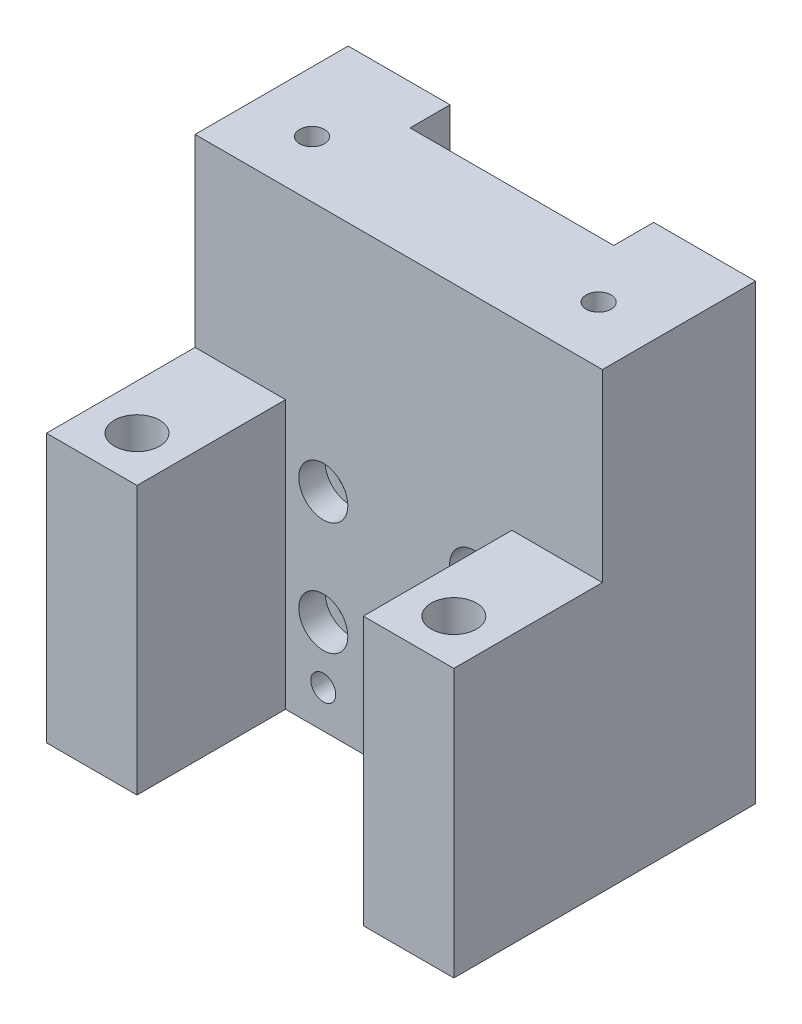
ISO-10303-21;
HEADER;
FILE_DESCRIPTION(('STEP AP214'),'2;1');
FILE_NAME('part.step','',(''),(''),'','','');
FILE_SCHEMA(('AUTOMOTIVE_DESIGN { 1 0 10303 214 1 1 1 1 }'));
ENDSEC;
DATA;
#1=APPLICATION_CONTEXT('core data for automotive mechanical design processes');
#2=APPLICATION_PROTOCOL_DEFINITION('international standard','automotive_design',2000,#1);
#3=PRODUCT_CONTEXT('',#1,'mechanical');
#4=PRODUCT('Part','Part','',(#3));
#5=PRODUCT_RELATED_PRODUCT_CATEGORY('part','',(#4));
#6=PRODUCT_DEFINITION_FORMATION('','',#4);
#7=PRODUCT_DEFINITION_CONTEXT('part definition',#1,'design');
#8=PRODUCT_DEFINITION('design','',#6,#7);
#9=PRODUCT_DEFINITION_SHAPE('','',#8);
#10=(LENGTH_UNIT() NAMED_UNIT(*) SI_UNIT(.MILLI.,.METRE.));
#11=(NAMED_UNIT(*) PLANE_ANGLE_UNIT() SI_UNIT($,.RADIAN.));
#12=(NAMED_UNIT(*) SI_UNIT($,.STERADIAN.) SOLID_ANGLE_UNIT());
#13=UNCERTAINTY_MEASURE_WITH_UNIT(LENGTH_MEASURE(1.E-05),#10,'distance_accuracy_value','');
#14=(GEOMETRIC_REPRESENTATION_CONTEXT(3) GLOBAL_UNCERTAINTY_ASSIGNED_CONTEXT((#13)) GLOBAL_UNIT_ASSIGNED_CONTEXT((#10,
#11,#12)) REPRESENTATION_CONTEXT('',''));
#15=CARTESIAN_POINT('',(0.,0.,0.));
#16=DIRECTION('',(0.,0.,1.));
#17=DIRECTION('',(1.,0.,0.));
#18=AXIS2_PLACEMENT_3D('',#15,#16,#17);
#19=CARTESIAN_POINT('',(17.,27.5000000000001,40.));
#20=DIRECTION('',(0.,0.,-1.));
#21=DIRECTION('',(-1.,0.,0.));
#22=AXIS2_PLACEMENT_3D('',#19,#20,#21);
#23=CYLINDRICAL_SURFACE('',#22,1.75);
#24=CARTESIAN_POINT('',(17.,27.5000000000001,5.29999999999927));
#25=DIRECTION('',(0.,0.,-1.));
#26=DIRECTION('',(-1.,0.,0.));
#27=AXIS2_PLACEMENT_3D('',#24,#25,#26);
#28=CIRCLE('',#27,1.75);
#29=CARTESIAN_POINT('',(15.25,27.5000000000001,5.29999999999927));
#30=VERTEX_POINT('',#29);
#31=EDGE_CURVE('E202',#30,#30,#28,.T.);
#32=ORIENTED_EDGE('',*,*,#31,.T.);
#33=EDGE_LOOP('',(#32));
#34=FACE_BOUND('',#33,.T.);
#35=CARTESIAN_POINT('',(17.,27.5000000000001,16.8000000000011));
#36=DIRECTION('',(0.,0.,1.));
#37=DIRECTION('',(1.,0.,0.));
#38=AXIS2_PLACEMENT_3D('',#35,#36,#37);
#39=CIRCLE('',#38,1.75);
#40=CARTESIAN_POINT('',(18.75,27.5000000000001,16.8000000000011));
#41=VERTEX_POINT('',#40);
#42=EDGE_CURVE('E37',#41,#41,#39,.T.);
#43=ORIENTED_EDGE('',*,*,#42,.T.);
#44=EDGE_LOOP('',(#43));
#45=FACE_BOUND('',#44,.T.);
#46=ADVANCED_FACE('F33',(#34,#45),#23,.F.);
#47=CARTESIAN_POINT('',(37.,27.5000000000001,40.));
#48=DIRECTION('',(0.,0.,-1.));
#49=DIRECTION('',(-1.,0.,0.));
#50=AXIS2_PLACEMENT_3D('',#47,#48,#49);
#51=CYLINDRICAL_SURFACE('',#50,1.75);
#52=CARTESIAN_POINT('',(37.,27.5000000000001,5.29999999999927));
#53=DIRECTION('',(0.,0.,-1.));
#54=DIRECTION('',(-1.,0.,0.));
#55=AXIS2_PLACEMENT_3D('',#52,#53,#54);
#56=CIRCLE('',#55,1.75);
#57=CARTESIAN_POINT('',(35.25,27.5000000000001,5.29999999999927));
#58=VERTEX_POINT('',#57);
#59=EDGE_CURVE('E205',#58,#58,#56,.T.);
#60=ORIENTED_EDGE('',*,*,#59,.T.);
#61=EDGE_LOOP('',(#60));
#62=FACE_BOUND('',#61,.T.);
#63=CARTESIAN_POINT('',(37.,27.5000000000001,16.8000000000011));
#64=DIRECTION('',(0.,0.,1.));
#65=DIRECTION('',(1.,0.,0.));
#66=AXIS2_PLACEMENT_3D('',#63,#64,#65);
#67=CIRCLE('',#66,1.75);
#68=CARTESIAN_POINT('',(38.75,27.5000000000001,16.8000000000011));
#69=VERTEX_POINT('',#68);
#70=EDGE_CURVE('E276',#69,#69,#67,.T.);
#71=ORIENTED_EDGE('',*,*,#70,.T.);
#72=EDGE_LOOP('',(#71));
#73=FACE_BOUND('',#72,.T.);
#74=ADVANCED_FACE('F319',(#62,#73),#51,.F.);
#75=CARTESIAN_POINT('',(37.,12.5000000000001,40.));
#76=DIRECTION('',(0.,0.,-1.));
#77=DIRECTION('',(-1.,0.,0.));
#78=AXIS2_PLACEMENT_3D('',#75,#76,#77);
#79=CYLINDRICAL_SURFACE('',#78,1.75);
#80=CARTESIAN_POINT('',(37.,12.5000000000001,5.29999999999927));
#81=DIRECTION('',(0.,0.,-1.));
#82=DIRECTION('',(-1.,0.,0.));
#83=AXIS2_PLACEMENT_3D('',#80,#81,#82);
#84=CIRCLE('',#83,1.75);
#85=CARTESIAN_POINT('',(35.25,12.5000000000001,5.29999999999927));
#86=VERTEX_POINT('',#85);
#87=EDGE_CURVE('E208',#86,#86,#84,.T.);
#88=ORIENTED_EDGE('',*,*,#87,.T.);
#89=EDGE_LOOP('',(#88));
#90=FACE_BOUND('',#89,.T.);
#91=CARTESIAN_POINT('',(37.,12.5000000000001,16.8000000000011));
#92=DIRECTION('',(0.,0.,1.));
#93=DIRECTION('',(1.,0.,0.));
#94=AXIS2_PLACEMENT_3D('',#91,#92,#93);
#95=CIRCLE('',#94,1.75);
#96=CARTESIAN_POINT('',(38.75,12.5000000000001,16.8000000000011));
#97=VERTEX_POINT('',#96);
#98=EDGE_CURVE('E272',#97,#97,#95,.T.);
#99=ORIENTED_EDGE('',*,*,#98,.T.);
#100=EDGE_LOOP('',(#99));
#101=FACE_BOUND('',#100,.T.);
#102=ADVANCED_FACE('F325',(#90,#101),#79,.F.);
#103=CARTESIAN_POINT('',(17.,12.5000000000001,40.));
#104=DIRECTION('',(0.,0.,-1.));
#105=DIRECTION('',(-1.,0.,0.));
#106=AXIS2_PLACEMENT_3D('',#103,#104,#105);
#107=CYLINDRICAL_SURFACE('',#106,1.75);
#108=CARTESIAN_POINT('',(17.,12.5000000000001,5.29999999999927));
#109=DIRECTION('',(0.,0.,-1.));
#110=DIRECTION('',(-1.,0.,0.));
#111=AXIS2_PLACEMENT_3D('',#108,#109,#110);
#112=CIRCLE('',#111,1.75);
#113=CARTESIAN_POINT('',(15.25,12.5000000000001,5.29999999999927));
#114=VERTEX_POINT('',#113);
#115=EDGE_CURVE('E211',#114,#114,#112,.T.);
#116=ORIENTED_EDGE('',*,*,#115,.T.);
#117=EDGE_LOOP('',(#116));
#118=FACE_BOUND('',#117,.T.);
#119=CARTESIAN_POINT('',(17.,12.5000000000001,16.8000000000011));
#120=DIRECTION('',(0.,0.,1.));
#121=DIRECTION('',(1.,0.,0.));
#122=AXIS2_PLACEMENT_3D('',#119,#120,#121);
#123=CIRCLE('',#122,1.75);
#124=CARTESIAN_POINT('',(18.75,12.5000000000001,16.8000000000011));
#125=VERTEX_POINT('',#124);
#126=EDGE_CURVE('E175',#125,#125,#123,.T.);
#127=ORIENTED_EDGE('',*,*,#126,.T.);
#128=EDGE_LOOP('',(#127));
#129=FACE_BOUND('',#128,.T.);
#130=ADVANCED_FACE('F335',(#118,#129),#107,.F.);
#131=CARTESIAN_POINT('',(0.,60.,40.));
#132=DIRECTION('',(0.,0.,-1.));
#133=DIRECTION('',(-1.,0.,0.));
#134=AXIS2_PLACEMENT_3D('',#131,#132,#133);
#135=PLANE('',#134);
#136=DIRECTION('',(0.,1.,0.));
#137=VECTOR('',#136,1.);
#138=CARTESIAN_POINT('',(42.,0.,39.9999999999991));
#139=LINE('',#138,#137);
#140=CARTESIAN_POINT('',(42.,0.,39.9999999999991));
#141=VERTEX_POINT('',#140);
#142=CARTESIAN_POINT('',(42.,35.5490451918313,39.9999999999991));
#143=VERTEX_POINT('',#142);
#144=EDGE_CURVE('E189',#141,#143,#139,.T.);
#145=ORIENTED_EDGE('',*,*,#144,.F.);
#146=DIRECTION('',(1.,0.,0.));
#147=VECTOR('',#146,1.);
#148=CARTESIAN_POINT('',(0.,0.,40.));
#149=LINE('',#148,#147);
#150=CARTESIAN_POINT('',(54.,0.,40.));
#151=VERTEX_POINT('',#150);
#152=EDGE_CURVE('E236',#141,#151,#149,.T.);
#153=ORIENTED_EDGE('',*,*,#152,.T.);
#154=DIRECTION('',(0.,1.,0.));
#155=VECTOR('',#154,1.);
#156=CARTESIAN_POINT('',(54.,0.,40.));
#157=LINE('',#156,#155);
#158=CARTESIAN_POINT('',(54.,35.5490451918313,40.));
#159=VERTEX_POINT('',#158);
#160=EDGE_CURVE('E240',#151,#159,#157,.T.);
#161=ORIENTED_EDGE('',*,*,#160,.T.);
#162=DIRECTION('',(1.,0.,0.));
#163=VECTOR('',#162,1.);
#164=CARTESIAN_POINT('',(0.,35.5490451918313,40.));
#165=LINE('',#164,#163);
#166=EDGE_CURVE('E222',#143,#159,#165,.T.);
#167=ORIENTED_EDGE('',*,*,#166,.F.);
#168=EDGE_LOOP('',(#145,#153,#161,#167));
#169=FACE_BOUND('',#168,.T.);
#170=ADVANCED_FACE('F339',(#169),#135,.F.);
#171=DIRECTION('',(0.,1.,0.));
#172=VECTOR('',#171,1.);
#173=CARTESIAN_POINT('',(12.,0.,40.));
#174=LINE('',#173,#172);
#175=CARTESIAN_POINT('',(12.,0.,40.));
#176=VERTEX_POINT('',#175);
#177=CARTESIAN_POINT('',(12.,35.5490451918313,40.));
#178=VERTEX_POINT('',#177);
#179=EDGE_CURVE('E145',#176,#178,#174,.T.);
#180=ORIENTED_EDGE('',*,*,#179,.T.);
#181=CARTESIAN_POINT('',(0.,35.5490451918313,40.));
#182=VERTEX_POINT('',#181);
#183=EDGE_CURVE('E231',#182,#178,#165,.T.);
#184=ORIENTED_EDGE('',*,*,#183,.F.);
#185=DIRECTION('',(0.,-1.,0.));
#186=VECTOR('',#185,1.);
#187=CARTESIAN_POINT('',(0.,0.,40.));
#188=LINE('',#187,#186);
#189=CARTESIAN_POINT('',(0.,0.,40.));
#190=VERTEX_POINT('',#189);
#191=EDGE_CURVE('E234',#182,#190,#188,.T.);
#192=ORIENTED_EDGE('',*,*,#191,.T.);
#193=EDGE_CURVE('E238',#190,#176,#149,.T.);
#194=ORIENTED_EDGE('',*,*,#193,.T.);
#195=EDGE_LOOP('',(#180,#184,#192,#194));
#196=FACE_BOUND('',#195,.T.);
#197=ADVANCED_FACE('F343',(#196),#135,.F.);
#198=CARTESIAN_POINT('',(0.,60.,0.));
#199=DIRECTION('',(0.,0.,-1.));
#200=DIRECTION('',(-1.,0.,0.));
#201=AXIS2_PLACEMENT_3D('',#198,#199,#200);
#202=PLANE('',#201);
#203=DIRECTION('',(-1.,0.,0.));
#204=VECTOR('',#203,1.);
#205=CARTESIAN_POINT('',(0.,60.,0.));
#206=LINE('',#205,#204);
#207=CARTESIAN_POINT('',(13.5,60.,0.));
#208=VERTEX_POINT('',#207);
#209=CARTESIAN_POINT('',(0.,60.,0.));
#210=VERTEX_POINT('',#209);
#211=EDGE_CURVE('E253',#208,#210,#206,.T.);
#212=ORIENTED_EDGE('',*,*,#211,.F.);
#213=DIRECTION('',(0.,1.,0.));
#214=VECTOR('',#213,1.);
#215=CARTESIAN_POINT('',(13.5,0.,0.));
#216=LINE('',#215,#214);
#217=CARTESIAN_POINT('',(13.5,0.,0.));
#218=VERTEX_POINT('',#217);
#219=EDGE_CURVE('E179',#218,#208,#216,.T.);
#220=ORIENTED_EDGE('',*,*,#219,.F.);
#221=DIRECTION('',(1.,0.,0.));
#222=VECTOR('',#221,1.);
#223=CARTESIAN_POINT('',(0.,0.,0.));
#224=LINE('',#223,#222);
#225=CARTESIAN_POINT('',(0.,0.,0.));
#226=VERTEX_POINT('',#225);
#227=EDGE_CURVE('E247',#226,#218,#224,.T.);
#228=ORIENTED_EDGE('',*,*,#227,.F.);
#229=DIRECTION('',(0.,-1.,0.));
#230=VECTOR('',#229,1.);
#231=CARTESIAN_POINT('',(0.,0.,0.));
#232=LINE('',#231,#230);
#233=EDGE_CURVE('E228',#210,#226,#232,.T.);
#234=ORIENTED_EDGE('',*,*,#233,.F.);
#235=EDGE_LOOP('',(#212,#220,#228,#234));
#236=FACE_BOUND('',#235,.T.);
#237=ADVANCED_FACE('F345',(#236),#202,.T.);
#238=CARTESIAN_POINT('',(40.5,0.,-9.09862463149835E-13));
#239=VERTEX_POINT('',#238);
#240=CARTESIAN_POINT('',(54.,0.,0.));
#241=VERTEX_POINT('',#240);
#242=EDGE_CURVE('E246',#239,#241,#224,.T.);
#243=ORIENTED_EDGE('',*,*,#242,.F.);
#244=DIRECTION('',(0.,1.,0.));
#245=VECTOR('',#244,1.);
#246=CARTESIAN_POINT('',(40.5,0.,-9.09862463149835E-13));
#247=LINE('',#246,#245);
#248=CARTESIAN_POINT('',(40.5,60.,-9.09862463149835E-13));
#249=VERTEX_POINT('',#248);
#250=EDGE_CURVE('E186',#239,#249,#247,.T.);
#251=ORIENTED_EDGE('',*,*,#250,.T.);
#252=CARTESIAN_POINT('',(54.,60.,0.));
#253=VERTEX_POINT('',#252);
#254=EDGE_CURVE('E237',#253,#249,#206,.T.);
#255=ORIENTED_EDGE('',*,*,#254,.F.);
#256=DIRECTION('',(0.,1.,0.));
#257=VECTOR('',#256,1.);
#258=CARTESIAN_POINT('',(54.,0.,0.));
#259=LINE('',#258,#257);
#260=EDGE_CURVE('E250',#241,#253,#259,.T.);
#261=ORIENTED_EDGE('',*,*,#260,.F.);
#262=EDGE_LOOP('',(#243,#251,#255,#261));
#263=FACE_BOUND('',#262,.T.);
#264=ADVANCED_FACE('F348',(#263),#202,.T.);
#265=CARTESIAN_POINT('',(0.,0.,40.));
#266=DIRECTION('',(0.,1.,0.));
#267=DIRECTION('',(0.,0.,1.));
#268=AXIS2_PLACEMENT_3D('',#265,#266,#267);
#269=PLANE('',#268);
#270=CARTESIAN_POINT('',(47.9999999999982,0.,34.));
#271=DIRECTION('',(0.,1.,0.));
#272=DIRECTION('',(0.,0.,1.));
#273=AXIS2_PLACEMENT_3D('',#270,#271,#272);
#274=CIRCLE('',#273,3.);
#275=CARTESIAN_POINT('',(47.9999999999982,0.,37.));
#276=VERTEX_POINT('',#275);
#277=EDGE_CURVE('E363',#276,#276,#274,.T.);
#278=ORIENTED_EDGE('',*,*,#277,.T.);
#279=EDGE_LOOP('',(#278));
#280=FACE_BOUND('',#279,.T.);
#281=CARTESIAN_POINT('',(5.99999999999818,0.,34.));
#282=DIRECTION('',(0.,1.,0.));
#283=DIRECTION('',(0.,0.,1.));
#284=AXIS2_PLACEMENT_3D('',#281,#282,#283);
#285=CIRCLE('',#284,3.);
#286=CARTESIAN_POINT('',(5.99999999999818,0.,37.));
#287=VERTEX_POINT('',#286);
#288=EDGE_CURVE('E366',#287,#287,#285,.T.);
#289=ORIENTED_EDGE('',*,*,#288,.T.);
#290=EDGE_LOOP('',(#289));
#291=FACE_BOUND('',#290,.T.);
#292=DIRECTION('',(0.,0.,-1.));
#293=VECTOR('',#292,1.);
#294=CARTESIAN_POINT('',(13.5,0.,5.29999999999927));
#295=LINE('',#294,#293);
#296=CARTESIAN_POINT('',(13.5,0.,5.29999999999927));
#297=VERTEX_POINT('',#296);
#298=EDGE_CURVE('E170',#297,#218,#295,.T.);
#299=ORIENTED_EDGE('',*,*,#298,.F.);
#300=DIRECTION('',(-1.,0.,0.));
#301=VECTOR('',#300,1.);
#302=CARTESIAN_POINT('',(13.5,0.,5.29999999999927));
#303=LINE('',#302,#301);
#304=CARTESIAN_POINT('',(40.5,0.,5.29999999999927));
#305=VERTEX_POINT('',#304);
#306=EDGE_CURVE('E167',#305,#297,#303,.T.);
#307=ORIENTED_EDGE('',*,*,#306,.F.);
#308=DIRECTION('',(0.,0.,1.));
#309=VECTOR('',#308,1.);
#310=CARTESIAN_POINT('',(40.5,0.,5.29999999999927));
#311=LINE('',#310,#309);
#312=EDGE_CURVE('E161',#239,#305,#311,.T.);
#313=ORIENTED_EDGE('',*,*,#312,.F.);
#314=ORIENTED_EDGE('',*,*,#242,.T.);
#315=DIRECTION('',(0.,0.,-1.));
#316=VECTOR('',#315,1.);
#317=CARTESIAN_POINT('',(54.,0.,40.));
#318=LINE('',#317,#316);
#319=EDGE_CURVE('E260',#151,#241,#318,.T.);
#320=ORIENTED_EDGE('',*,*,#319,.F.);
#321=ORIENTED_EDGE('',*,*,#152,.F.);
#322=DIRECTION('',(0.,0.,1.));
#323=VECTOR('',#322,1.);
#324=CARTESIAN_POINT('',(42.,0.,39.9999999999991));
#325=LINE('',#324,#323);
#326=CARTESIAN_POINT('',(42.,0.,20.2999999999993));
#327=VERTEX_POINT('',#326);
#328=EDGE_CURVE('E159',#327,#141,#325,.T.);
#329=ORIENTED_EDGE('',*,*,#328,.F.);
#330=DIRECTION('',(1.,0.,0.));
#331=VECTOR('',#330,1.);
#332=CARTESIAN_POINT('',(12.,0.,20.2999999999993));
#333=LINE('',#332,#331);
#334=CARTESIAN_POINT('',(12.,0.,20.2999999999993));
#335=VERTEX_POINT('',#334);
#336=EDGE_CURVE('E140',#335,#327,#333,.T.);
#337=ORIENTED_EDGE('',*,*,#336,.F.);
#338=DIRECTION('',(0.,0.,-1.));
#339=VECTOR('',#338,1.);
#340=CARTESIAN_POINT('',(12.,0.,40.));
#341=LINE('',#340,#339);
#342=EDGE_CURVE('E148',#176,#335,#341,.T.);
#343=ORIENTED_EDGE('',*,*,#342,.F.);
#344=ORIENTED_EDGE('',*,*,#193,.F.);
#345=DIRECTION('',(0.,0.,-1.));
#346=VECTOR('',#345,1.);
#347=CARTESIAN_POINT('',(0.,0.,40.));
#348=LINE('',#347,#346);
#349=EDGE_CURVE('E263',#190,#226,#348,.T.);
#350=ORIENTED_EDGE('',*,*,#349,.T.);
#351=ORIENTED_EDGE('',*,*,#227,.T.);
#352=EDGE_LOOP('',(#299,#307,#313,#314,#320,#321,#329,#337,#343,#344,#350,#351));
#353=FACE_BOUND('',#352,.T.);
#354=ADVANCED_FACE('F157',(#280,#291,#353),#269,.F.);
#355=CARTESIAN_POINT('',(0.,60.,40.));
#356=DIRECTION('',(0.,-1.,0.));
#357=DIRECTION('',(0.,0.,-1.));
#358=AXIS2_PLACEMENT_3D('',#355,#356,#357);
#359=PLANE('',#358);
#360=CARTESIAN_POINT('',(45.9999999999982,60.,12.8000000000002));
#361=DIRECTION('',(0.,1.,0.));
#362=DIRECTION('',(0.,0.,1.));
#363=AXIS2_PLACEMENT_3D('',#360,#361,#362);
#364=CIRCLE('',#363,1.65);
#365=CARTESIAN_POINT('',(45.9999999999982,60.,14.4500000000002));
#366=VERTEX_POINT('',#365);
#367=EDGE_CURVE('E368',#366,#366,#364,.T.);
#368=ORIENTED_EDGE('',*,*,#367,.F.);
#369=EDGE_LOOP('',(#368));
#370=FACE_BOUND('',#369,.T.);
#371=CARTESIAN_POINT('',(7.99999999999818,60.,12.8000000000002));
#372=DIRECTION('',(0.,1.,0.));
#373=DIRECTION('',(0.,0.,1.));
#374=AXIS2_PLACEMENT_3D('',#371,#372,#373);
#375=CIRCLE('',#374,1.65);
#376=CARTESIAN_POINT('',(7.99999999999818,60.,14.4500000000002));
#377=VERTEX_POINT('',#376);
#378=EDGE_CURVE('E381',#377,#377,#375,.T.);
#379=ORIENTED_EDGE('',*,*,#378,.F.);
#380=EDGE_LOOP('',(#379));
#381=FACE_BOUND('',#380,.T.);
#382=DIRECTION('',(0.,0.,-1.));
#383=VECTOR('',#382,1.);
#384=CARTESIAN_POINT('',(13.5,60.,5.29999999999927));
#385=LINE('',#384,#383);
#386=CARTESIAN_POINT('',(13.5,60.,5.29999999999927));
#387=VERTEX_POINT('',#386);
#388=EDGE_CURVE('E154',#387,#208,#385,.T.);
#389=ORIENTED_EDGE('',*,*,#388,.T.);
#390=ORIENTED_EDGE('',*,*,#211,.T.);
#391=DIRECTION('',(0.,0.,-1.));
#392=VECTOR('',#391,1.);
#393=CARTESIAN_POINT('',(0.,60.,40.));
#394=LINE('',#393,#392);
#395=CARTESIAN_POINT('',(0.,60.,20.3000000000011));
#396=VERTEX_POINT('',#395);
#397=EDGE_CURVE('E243',#396,#210,#394,.T.);
#398=ORIENTED_EDGE('',*,*,#397,.F.);
#399=DIRECTION('',(1.,0.,0.));
#400=VECTOR('',#399,1.);
#401=CARTESIAN_POINT('',(0.,60.,20.3000000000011));
#402=LINE('',#401,#400);
#403=CARTESIAN_POINT('',(54.,60.,20.3000000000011));
#404=VERTEX_POINT('',#403);
#405=EDGE_CURVE('E226',#396,#404,#402,.T.);
#406=ORIENTED_EDGE('',*,*,#405,.T.);
#407=DIRECTION('',(0.,0.,-1.));
#408=VECTOR('',#407,1.);
#409=CARTESIAN_POINT('',(54.,60.,40.));
#410=LINE('',#409,#408);
#411=EDGE_CURVE('E258',#404,#253,#410,.T.);
#412=ORIENTED_EDGE('',*,*,#411,.T.);
#413=ORIENTED_EDGE('',*,*,#254,.T.);
#414=DIRECTION('',(0.,0.,1.));
#415=VECTOR('',#414,1.);
#416=CARTESIAN_POINT('',(40.5,60.,5.29999999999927));
#417=LINE('',#416,#415);
#418=CARTESIAN_POINT('',(40.5,60.,5.29999999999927));
#419=VERTEX_POINT('',#418);
#420=EDGE_CURVE('E172',#249,#419,#417,.T.);
#421=ORIENTED_EDGE('',*,*,#420,.T.);
#422=DIRECTION('',(-1.,0.,0.));
#423=VECTOR('',#422,1.);
#424=CARTESIAN_POINT('',(13.5,60.,5.29999999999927));
#425=LINE('',#424,#423);
#426=EDGE_CURVE('E50',#419,#387,#425,.T.);
#427=ORIENTED_EDGE('',*,*,#426,.T.);
#428=EDGE_LOOP('',(#389,#390,#398,#406,#412,#413,#421,#427));
#429=FACE_BOUND('',#428,.T.);
#430=ADVANCED_FACE('F350',(#370,#381,#429),#359,.F.);
#431=CARTESIAN_POINT('',(0.,35.5490451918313,40.));
#432=DIRECTION('',(0.,-1.,0.));
#433=DIRECTION('',(0.,0.,-1.));
#434=AXIS2_PLACEMENT_3D('',#431,#432,#433);
#435=PLANE('',#434);
#436=CARTESIAN_POINT('',(47.9999999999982,35.5490451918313,34.));
#437=DIRECTION('',(0.,1.,0.));
#438=DIRECTION('',(0.,0.,1.));
#439=AXIS2_PLACEMENT_3D('',#436,#437,#438);
#440=CIRCLE('',#439,3.);
#441=CARTESIAN_POINT('',(47.9999999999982,35.5490451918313,37.));
#442=VERTEX_POINT('',#441);
#443=EDGE_CURVE('E377',#442,#442,#440,.T.);
#444=ORIENTED_EDGE('',*,*,#443,.F.);
#445=EDGE_LOOP('',(#444));
#446=FACE_BOUND('',#445,.T.);
#447=DIRECTION('',(0.,0.,-1.));
#448=VECTOR('',#447,1.);
#449=CARTESIAN_POINT('',(42.,35.5490451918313,40.));
#450=LINE('',#449,#448);
#451=CARTESIAN_POINT('',(42.,35.5490451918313,20.2999999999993));
#452=VERTEX_POINT('',#451);
#453=EDGE_CURVE('E12',#143,#452,#450,.T.);
#454=ORIENTED_EDGE('',*,*,#453,.F.);
#455=ORIENTED_EDGE('',*,*,#166,.T.);
#456=DIRECTION('',(0.,0.,-1.));
#457=VECTOR('',#456,1.);
#458=CARTESIAN_POINT('',(54.,35.5490451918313,40.));
#459=LINE('',#458,#457);
#460=CARTESIAN_POINT('',(54.,35.5490451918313,20.3000000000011));
#461=VERTEX_POINT('',#460);
#462=EDGE_CURVE('E214',#159,#461,#459,.T.);
#463=ORIENTED_EDGE('',*,*,#462,.T.);
#464=DIRECTION('',(1.,0.,0.));
#465=VECTOR('',#464,1.);
#466=CARTESIAN_POINT('',(0.,35.5490451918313,20.3000000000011));
#467=LINE('',#466,#465);
#468=EDGE_CURVE('E230',#452,#461,#467,.T.);
#469=ORIENTED_EDGE('',*,*,#468,.F.);
#470=EDGE_LOOP('',(#454,#455,#463,#469));
#471=FACE_BOUND('',#470,.T.);
#472=ADVANCED_FACE('F352',(#446,#471),#435,.F.);
#473=CARTESIAN_POINT('',(5.99999999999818,35.5490451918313,34.));
#474=DIRECTION('',(0.,1.,0.));
#475=DIRECTION('',(0.,0.,1.));
#476=AXIS2_PLACEMENT_3D('',#473,#474,#475);
#477=CIRCLE('',#476,3.);
#478=CARTESIAN_POINT('',(5.99999999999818,35.5490451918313,37.));
#479=VERTEX_POINT('',#478);
#480=EDGE_CURVE('E369',#479,#479,#477,.T.);
#481=ORIENTED_EDGE('',*,*,#480,.F.);
#482=EDGE_LOOP('',(#481));
#483=FACE_BOUND('',#482,.T.);
#484=DIRECTION('',(0.,0.,1.));
#485=VECTOR('',#484,1.);
#486=CARTESIAN_POINT('',(12.,35.5490451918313,40.));
#487=LINE('',#486,#485);
#488=CARTESIAN_POINT('',(12.,35.5490451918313,20.3000000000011));
#489=VERTEX_POINT('',#488);
#490=EDGE_CURVE('E42',#489,#178,#487,.T.);
#491=ORIENTED_EDGE('',*,*,#490,.F.);
#492=CARTESIAN_POINT('',(0.,35.5490451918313,20.3000000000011));
#493=VERTEX_POINT('',#492);
#494=EDGE_CURVE('E143',#493,#489,#467,.T.);
#495=ORIENTED_EDGE('',*,*,#494,.F.);
#496=DIRECTION('',(0.,0.,-1.));
#497=VECTOR('',#496,1.);
#498=CARTESIAN_POINT('',(0.,35.5490451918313,40.));
#499=LINE('',#498,#497);
#500=EDGE_CURVE('E215',#182,#493,#499,.T.);
#501=ORIENTED_EDGE('',*,*,#500,.F.);
#502=ORIENTED_EDGE('',*,*,#183,.T.);
#503=EDGE_LOOP('',(#491,#495,#501,#502));
#504=FACE_BOUND('',#503,.T.);
#505=ADVANCED_FACE('F470',(#483,#504),#435,.F.);
#506=CARTESIAN_POINT('',(0.,0.,40.));
#507=DIRECTION('',(1.,0.,0.));
#508=DIRECTION('',(0.,0.,-1.));
#509=AXIS2_PLACEMENT_3D('',#506,#507,#508);
#510=PLANE('',#509);
#511=ORIENTED_EDGE('',*,*,#500,.T.);
#512=DIRECTION('',(0.,1.,0.));
#513=VECTOR('',#512,1.);
#514=CARTESIAN_POINT('',(0.,35.5490451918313,20.3000000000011));
#515=LINE('',#514,#513);
#516=EDGE_CURVE('E218',#493,#396,#515,.T.);
#517=ORIENTED_EDGE('',*,*,#516,.T.);
#518=ORIENTED_EDGE('',*,*,#397,.T.);
#519=ORIENTED_EDGE('',*,*,#233,.T.);
#520=ORIENTED_EDGE('',*,*,#349,.F.);
#521=ORIENTED_EDGE('',*,*,#191,.F.);
#522=EDGE_LOOP('',(#511,#517,#518,#519,#520,#521));
#523=FACE_BOUND('',#522,.T.);
#524=ADVANCED_FACE('F35',(#523),#510,.F.);
#525=CARTESIAN_POINT('',(54.,0.,40.));
#526=DIRECTION('',(-1.,0.,0.));
#527=DIRECTION('',(0.,0.,1.));
#528=AXIS2_PLACEMENT_3D('',#525,#526,#527);
#529=PLANE('',#528);
#530=ORIENTED_EDGE('',*,*,#411,.F.);
#531=DIRECTION('',(0.,1.,0.));
#532=VECTOR('',#531,1.);
#533=CARTESIAN_POINT('',(54.,60.,20.3000000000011));
#534=LINE('',#533,#532);
#535=EDGE_CURVE('E219',#461,#404,#534,.T.);
#536=ORIENTED_EDGE('',*,*,#535,.F.);
#537=ORIENTED_EDGE('',*,*,#462,.F.);
#538=ORIENTED_EDGE('',*,*,#160,.F.);
#539=ORIENTED_EDGE('',*,*,#319,.T.);
#540=ORIENTED_EDGE('',*,*,#260,.T.);
#541=EDGE_LOOP('',(#530,#536,#537,#538,#539,#540));
#542=FACE_BOUND('',#541,.T.);
#543=ADVANCED_FACE('F304',(#542),#529,.F.);
#544=CARTESIAN_POINT('',(0.,60.,20.3000000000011));
#545=DIRECTION('',(0.,0.,-1.));
#546=DIRECTION('',(-1.,0.,0.));
#547=AXIS2_PLACEMENT_3D('',#544,#545,#546);
#548=PLANE('',#547);
#549=CARTESIAN_POINT('',(17.,27.5000000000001,20.3000000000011));
#550=DIRECTION('',(0.,0.,1.));
#551=DIRECTION('',(1.,0.,0.));
#552=AXIS2_PLACEMENT_3D('',#549,#550,#551);
#553=CIRCLE('',#552,3.25);
#554=CARTESIAN_POINT('',(20.25,27.5000000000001,20.3000000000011));
#555=VERTEX_POINT('',#554);
#556=EDGE_CURVE('E292',#555,#555,#553,.T.);
#557=ORIENTED_EDGE('',*,*,#556,.F.);
#558=EDGE_LOOP('',(#557));
#559=FACE_BOUND('',#558,.T.);
#560=CARTESIAN_POINT('',(37.,27.5000000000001,20.3000000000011));
#561=DIRECTION('',(0.,0.,1.));
#562=DIRECTION('',(1.,0.,0.));
#563=AXIS2_PLACEMENT_3D('',#560,#561,#562);
#564=CIRCLE('',#563,3.25);
#565=CARTESIAN_POINT('',(40.25,27.5000000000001,20.3000000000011));
#566=VERTEX_POINT('',#565);
#567=EDGE_CURVE('E285',#566,#566,#564,.T.);
#568=ORIENTED_EDGE('',*,*,#567,.F.);
#569=EDGE_LOOP('',(#568));
#570=FACE_BOUND('',#569,.T.);
#571=CARTESIAN_POINT('',(37.,12.5000000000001,20.3000000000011));
#572=DIRECTION('',(0.,0.,1.));
#573=DIRECTION('',(1.,0.,0.));
#574=AXIS2_PLACEMENT_3D('',#571,#572,#573);
#575=CIRCLE('',#574,3.25);
#576=CARTESIAN_POINT('',(40.25,12.5000000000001,20.3000000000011));
#577=VERTEX_POINT('',#576);
#578=EDGE_CURVE('E278',#577,#577,#575,.T.);
#579=ORIENTED_EDGE('',*,*,#578,.F.);
#580=EDGE_LOOP('',(#579));
#581=FACE_BOUND('',#580,.T.);
#582=CARTESIAN_POINT('',(17.,12.5000000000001,20.3000000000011));
#583=DIRECTION('',(0.,0.,1.));
#584=DIRECTION('',(1.,0.,0.));
#585=AXIS2_PLACEMENT_3D('',#582,#583,#584);
#586=CIRCLE('',#585,3.25);
#587=CARTESIAN_POINT('',(20.25,12.5000000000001,20.3000000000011));
#588=VERTEX_POINT('',#587);
#589=EDGE_CURVE('E274',#588,#588,#586,.T.);
#590=ORIENTED_EDGE('',*,*,#589,.F.);
#591=EDGE_LOOP('',(#590));
#592=FACE_BOUND('',#591,.T.);
#593=ORIENTED_EDGE('',*,*,#535,.T.);
#594=ORIENTED_EDGE('',*,*,#405,.F.);
#595=ORIENTED_EDGE('',*,*,#516,.F.);
#596=ORIENTED_EDGE('',*,*,#494,.T.);
#597=DIRECTION('',(0.,1.,0.));
#598=VECTOR('',#597,1.);
#599=CARTESIAN_POINT('',(12.,0.,20.2999999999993));
#600=LINE('',#599,#598);
#601=EDGE_CURVE('E58',#335,#489,#600,.T.);
#602=ORIENTED_EDGE('',*,*,#601,.F.);
#603=ORIENTED_EDGE('',*,*,#336,.T.);
#604=DIRECTION('',(0.,1.,0.));
#605=VECTOR('',#604,1.);
#606=CARTESIAN_POINT('',(42.,0.,20.2999999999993));
#607=LINE('',#606,#605);
#608=EDGE_CURVE('E144',#327,#452,#607,.T.);
#609=ORIENTED_EDGE('',*,*,#608,.T.);
#610=ORIENTED_EDGE('',*,*,#468,.T.);
#611=EDGE_LOOP('',(#593,#594,#595,#596,#602,#603,#609,#610));
#612=FACE_BOUND('',#611,.T.);
#613=CARTESIAN_POINT('',(17.,5.,20.2999999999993));
#614=DIRECTION('',(0.,0.,1.));
#615=DIRECTION('',(1.,0.,0.));
#616=AXIS2_PLACEMENT_3D('',#613,#614,#615);
#617=CIRCLE('',#616,1.65);
#618=CARTESIAN_POINT('',(18.65,5.,20.2999999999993));
#619=VERTEX_POINT('',#618);
#620=EDGE_CURVE('E195',#619,#619,#617,.T.);
#621=ORIENTED_EDGE('',*,*,#620,.F.);
#622=EDGE_LOOP('',(#621));
#623=FACE_BOUND('',#622,.T.);
#624=CARTESIAN_POINT('',(37.,5.,20.2999999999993));
#625=DIRECTION('',(0.,0.,1.));
#626=DIRECTION('',(1.,0.,0.));
#627=AXIS2_PLACEMENT_3D('',#624,#625,#626);
#628=CIRCLE('',#627,1.65);
#629=CARTESIAN_POINT('',(38.65,5.,20.2999999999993));
#630=VERTEX_POINT('',#629);
#631=EDGE_CURVE('E181',#630,#630,#628,.T.);
#632=ORIENTED_EDGE('',*,*,#631,.F.);
#633=EDGE_LOOP('',(#632));
#634=FACE_BOUND('',#633,.T.);
#635=ADVANCED_FACE('F136',(#559,#570,#581,#592,#612,#623,#634),#548,.F.);
#636=CARTESIAN_POINT('',(12.,0.,40.));
#637=DIRECTION('',(1.,0.,0.));
#638=DIRECTION('',(0.,0.,-1.));
#639=AXIS2_PLACEMENT_3D('',#636,#637,#638);
#640=PLANE('',#639);
#641=ORIENTED_EDGE('',*,*,#490,.T.);
#642=ORIENTED_EDGE('',*,*,#179,.F.);
#643=ORIENTED_EDGE('',*,*,#342,.T.);
#644=ORIENTED_EDGE('',*,*,#601,.T.);
#645=EDGE_LOOP('',(#641,#642,#643,#644));
#646=FACE_BOUND('',#645,.T.);
#647=ADVANCED_FACE('F149',(#646),#640,.T.);
#648=CARTESIAN_POINT('',(42.,0.,39.9999999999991));
#649=DIRECTION('',(-1.,0.,0.));
#650=DIRECTION('',(0.,0.,1.));
#651=AXIS2_PLACEMENT_3D('',#648,#649,#650);
#652=PLANE('',#651);
#653=ORIENTED_EDGE('',*,*,#453,.T.);
#654=ORIENTED_EDGE('',*,*,#608,.F.);
#655=ORIENTED_EDGE('',*,*,#328,.T.);
#656=ORIENTED_EDGE('',*,*,#144,.T.);
#657=EDGE_LOOP('',(#653,#654,#655,#656));
#658=FACE_BOUND('',#657,.T.);
#659=ADVANCED_FACE('F311',(#658),#652,.T.);
#660=CARTESIAN_POINT('',(37.,5.,40.));
#661=DIRECTION('',(0.,0.,-1.));
#662=DIRECTION('',(-1.,0.,0.));
#663=AXIS2_PLACEMENT_3D('',#660,#661,#662);
#664=CYLINDRICAL_SURFACE('',#663,1.65);
#665=ORIENTED_EDGE('',*,*,#631,.T.);
#666=EDGE_LOOP('',(#665));
#667=FACE_BOUND('',#666,.T.);
#668=CARTESIAN_POINT('',(37.,5.,5.29999999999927));
#669=DIRECTION('',(0.,0.,-1.));
#670=DIRECTION('',(-1.,0.,0.));
#671=AXIS2_PLACEMENT_3D('',#668,#669,#670);
#672=CIRCLE('',#671,1.65);
#673=CARTESIAN_POINT('',(35.35,5.,5.29999999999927));
#674=VERTEX_POINT('',#673);
#675=EDGE_CURVE('E198',#674,#674,#672,.T.);
#676=ORIENTED_EDGE('',*,*,#675,.T.);
#677=EDGE_LOOP('',(#676));
#678=FACE_BOUND('',#677,.T.);
#679=ADVANCED_FACE('F434',(#667,#678),#664,.F.);
#680=CARTESIAN_POINT('',(13.5,0.,5.29999999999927));
#681=DIRECTION('',(1.,0.,0.));
#682=DIRECTION('',(0.,0.,-1.));
#683=AXIS2_PLACEMENT_3D('',#680,#681,#682);
#684=PLANE('',#683);
#685=ORIENTED_EDGE('',*,*,#388,.F.);
#686=DIRECTION('',(0.,1.,0.));
#687=VECTOR('',#686,1.);
#688=CARTESIAN_POINT('',(13.5,0.,5.29999999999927));
#689=LINE('',#688,#687);
#690=EDGE_CURVE('E182',#297,#387,#689,.T.);
#691=ORIENTED_EDGE('',*,*,#690,.F.);
#692=ORIENTED_EDGE('',*,*,#298,.T.);
#693=ORIENTED_EDGE('',*,*,#219,.T.);
#694=EDGE_LOOP('',(#685,#691,#692,#693));
#695=FACE_BOUND('',#694,.T.);
#696=ADVANCED_FACE('F430',(#695),#684,.T.);
#697=CARTESIAN_POINT('',(13.5,0.,5.29999999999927));
#698=DIRECTION('',(0.,0.,-1.));
#699=DIRECTION('',(-1.,0.,0.));
#700=AXIS2_PLACEMENT_3D('',#697,#698,#699);
#701=PLANE('',#700);
#702=ORIENTED_EDGE('',*,*,#115,.F.);
#703=EDGE_LOOP('',(#702));
#704=FACE_BOUND('',#703,.T.);
#705=ORIENTED_EDGE('',*,*,#87,.F.);
#706=EDGE_LOOP('',(#705));
#707=FACE_BOUND('',#706,.T.);
#708=ORIENTED_EDGE('',*,*,#59,.F.);
#709=EDGE_LOOP('',(#708));
#710=FACE_BOUND('',#709,.T.);
#711=ORIENTED_EDGE('',*,*,#31,.F.);
#712=EDGE_LOOP('',(#711));
#713=FACE_BOUND('',#712,.T.);
#714=CARTESIAN_POINT('',(17.,5.,5.29999999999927));
#715=DIRECTION('',(0.,0.,-1.));
#716=DIRECTION('',(-1.,0.,0.));
#717=AXIS2_PLACEMENT_3D('',#714,#715,#716);
#718=CIRCLE('',#717,1.65);
#719=CARTESIAN_POINT('',(15.35,5.,5.29999999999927));
#720=VERTEX_POINT('',#719);
#721=EDGE_CURVE('E199',#720,#720,#718,.T.);
#722=ORIENTED_EDGE('',*,*,#721,.F.);
#723=EDGE_LOOP('',(#722));
#724=FACE_BOUND('',#723,.T.);
#725=ORIENTED_EDGE('',*,*,#675,.F.);
#726=EDGE_LOOP('',(#725));
#727=FACE_BOUND('',#726,.T.);
#728=ORIENTED_EDGE('',*,*,#426,.F.);
#729=DIRECTION('',(0.,1.,0.));
#730=VECTOR('',#729,1.);
#731=CARTESIAN_POINT('',(40.5,0.,5.29999999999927));
#732=LINE('',#731,#730);
#733=EDGE_CURVE('E184',#305,#419,#732,.T.);
#734=ORIENTED_EDGE('',*,*,#733,.F.);
#735=ORIENTED_EDGE('',*,*,#306,.T.);
#736=ORIENTED_EDGE('',*,*,#690,.T.);
#737=EDGE_LOOP('',(#728,#734,#735,#736));
#738=FACE_BOUND('',#737,.T.);
#739=ADVANCED_FACE('F433',(#704,#707,#710,#713,#724,#727,#738),#701,.T.);
#740=CARTESIAN_POINT('',(40.5,0.,5.29999999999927));
#741=DIRECTION('',(-1.,0.,0.));
#742=DIRECTION('',(0.,0.,1.));
#743=AXIS2_PLACEMENT_3D('',#740,#741,#742);
#744=PLANE('',#743);
#745=ORIENTED_EDGE('',*,*,#420,.F.);
#746=ORIENTED_EDGE('',*,*,#250,.F.);
#747=ORIENTED_EDGE('',*,*,#312,.T.);
#748=ORIENTED_EDGE('',*,*,#733,.T.);
#749=EDGE_LOOP('',(#745,#746,#747,#748));
#750=FACE_BOUND('',#749,.T.);
#751=ADVANCED_FACE('F438',(#750),#744,.T.);
#752=CARTESIAN_POINT('',(17.,5.,40.));
#753=DIRECTION('',(0.,0.,-1.));
#754=DIRECTION('',(-1.,0.,0.));
#755=AXIS2_PLACEMENT_3D('',#752,#753,#754);
#756=CYLINDRICAL_SURFACE('',#755,1.65);
#757=ORIENTED_EDGE('',*,*,#620,.T.);
#758=EDGE_LOOP('',(#757));
#759=FACE_BOUND('',#758,.T.);
#760=ORIENTED_EDGE('',*,*,#721,.T.);
#761=EDGE_LOOP('',(#760));
#762=FACE_BOUND('',#761,.T.);
#763=ADVANCED_FACE('F330',(#759,#762),#756,.F.);
#764=CARTESIAN_POINT('',(17.,12.5000000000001,16.8000000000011));
#765=DIRECTION('',(0.,0.,1.));
#766=DIRECTION('',(1.,0.,0.));
#767=AXIS2_PLACEMENT_3D('',#764,#765,#766);
#768=CYLINDRICAL_SURFACE('',#767,3.25);
#769=CARTESIAN_POINT('',(17.,12.5000000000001,16.8000000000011));
#770=DIRECTION('',(0.,0.,1.));
#771=DIRECTION('',(1.,0.,0.));
#772=AXIS2_PLACEMENT_3D('',#769,#770,#771);
#773=CIRCLE('',#772,3.25);
#774=CARTESIAN_POINT('',(20.25,12.5000000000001,16.8000000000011));
#775=VERTEX_POINT('',#774);
#776=EDGE_CURVE('E271',#775,#775,#773,.T.);
#777=ORIENTED_EDGE('',*,*,#776,.F.);
#778=EDGE_LOOP('',(#777));
#779=FACE_BOUND('',#778,.T.);
#780=ORIENTED_EDGE('',*,*,#589,.T.);
#781=EDGE_LOOP('',(#780));
#782=FACE_BOUND('',#781,.T.);
#783=ADVANCED_FACE('F301',(#779,#782),#768,.F.);
#784=CARTESIAN_POINT('',(17.,12.5000000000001,16.8000000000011));
#785=DIRECTION('',(0.,0.,1.));
#786=DIRECTION('',(1.,0.,0.));
#787=AXIS2_PLACEMENT_3D('',#784,#785,#786);
#788=PLANE('',#787);
#789=ORIENTED_EDGE('',*,*,#126,.F.);
#790=EDGE_LOOP('',(#789));
#791=FACE_BOUND('',#790,.T.);
#792=ORIENTED_EDGE('',*,*,#776,.T.);
#793=EDGE_LOOP('',(#792));
#794=FACE_BOUND('',#793,.T.);
#795=ADVANCED_FACE('F422',(#791,#794),#788,.T.);
#796=CARTESIAN_POINT('',(37.,12.5000000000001,16.8000000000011));
#797=DIRECTION('',(0.,0.,1.));
#798=DIRECTION('',(1.,0.,0.));
#799=AXIS2_PLACEMENT_3D('',#796,#797,#798);
#800=CYLINDRICAL_SURFACE('',#799,3.25);
#801=CARTESIAN_POINT('',(37.,12.5000000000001,16.8000000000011));
#802=DIRECTION('',(0.,0.,1.));
#803=DIRECTION('',(1.,0.,0.));
#804=AXIS2_PLACEMENT_3D('',#801,#802,#803);
#805=CIRCLE('',#804,3.25);
#806=CARTESIAN_POINT('',(40.25,12.5000000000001,16.8000000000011));
#807=VERTEX_POINT('',#806);
#808=EDGE_CURVE('E275',#807,#807,#805,.T.);
#809=ORIENTED_EDGE('',*,*,#808,.F.);
#810=EDGE_LOOP('',(#809));
#811=FACE_BOUND('',#810,.T.);
#812=ORIENTED_EDGE('',*,*,#578,.T.);
#813=EDGE_LOOP('',(#812));
#814=FACE_BOUND('',#813,.T.);
#815=ADVANCED_FACE('F418',(#811,#814),#800,.F.);
#816=CARTESIAN_POINT('',(37.,12.5000000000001,16.8000000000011));
#817=DIRECTION('',(0.,0.,1.));
#818=DIRECTION('',(1.,0.,0.));
#819=AXIS2_PLACEMENT_3D('',#816,#817,#818);
#820=PLANE('',#819);
#821=ORIENTED_EDGE('',*,*,#98,.F.);
#822=EDGE_LOOP('',(#821));
#823=FACE_BOUND('',#822,.T.);
#824=ORIENTED_EDGE('',*,*,#808,.T.);
#825=EDGE_LOOP('',(#824));
#826=FACE_BOUND('',#825,.T.);
#827=ADVANCED_FACE('F414',(#823,#826),#820,.T.);
#828=CARTESIAN_POINT('',(37.,27.5000000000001,16.8000000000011));
#829=DIRECTION('',(0.,0.,1.));
#830=DIRECTION('',(1.,0.,0.));
#831=AXIS2_PLACEMENT_3D('',#828,#829,#830);
#832=CYLINDRICAL_SURFACE('',#831,3.25);
#833=CARTESIAN_POINT('',(37.,27.5000000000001,16.8000000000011));
#834=DIRECTION('',(0.,0.,1.));
#835=DIRECTION('',(1.,0.,0.));
#836=AXIS2_PLACEMENT_3D('',#833,#834,#835);
#837=CIRCLE('',#836,3.25);
#838=CARTESIAN_POINT('',(40.25,27.5000000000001,16.8000000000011));
#839=VERTEX_POINT('',#838);
#840=EDGE_CURVE('E279',#839,#839,#837,.T.);
#841=ORIENTED_EDGE('',*,*,#840,.F.);
#842=EDGE_LOOP('',(#841));
#843=FACE_BOUND('',#842,.T.);
#844=ORIENTED_EDGE('',*,*,#567,.T.);
#845=EDGE_LOOP('',(#844));
#846=FACE_BOUND('',#845,.T.);
#847=ADVANCED_FACE('F407',(#843,#846),#832,.F.);
#848=CARTESIAN_POINT('',(37.,27.5000000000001,16.8000000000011));
#849=DIRECTION('',(0.,0.,1.));
#850=DIRECTION('',(1.,0.,0.));
#851=AXIS2_PLACEMENT_3D('',#848,#849,#850);
#852=PLANE('',#851);
#853=ORIENTED_EDGE('',*,*,#70,.F.);
#854=EDGE_LOOP('',(#853));
#855=FACE_BOUND('',#854,.T.);
#856=ORIENTED_EDGE('',*,*,#840,.T.);
#857=EDGE_LOOP('',(#856));
#858=FACE_BOUND('',#857,.T.);
#859=ADVANCED_FACE('F397',(#855,#858),#852,.T.);
#860=CARTESIAN_POINT('',(17.,27.5000000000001,16.8000000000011));
#861=DIRECTION('',(0.,0.,1.));
#862=DIRECTION('',(1.,0.,0.));
#863=AXIS2_PLACEMENT_3D('',#860,#861,#862);
#864=CYLINDRICAL_SURFACE('',#863,3.25);
#865=CARTESIAN_POINT('',(17.,27.5000000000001,16.8000000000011));
#866=DIRECTION('',(0.,0.,1.));
#867=DIRECTION('',(1.,0.,0.));
#868=AXIS2_PLACEMENT_3D('',#865,#866,#867);
#869=CIRCLE('',#868,3.25);
#870=CARTESIAN_POINT('',(20.25,27.5000000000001,16.8000000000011));
#871=VERTEX_POINT('',#870);
#872=EDGE_CURVE('E387',#871,#871,#869,.T.);
#873=ORIENTED_EDGE('',*,*,#872,.F.);
#874=EDGE_LOOP('',(#873));
#875=FACE_BOUND('',#874,.T.);
#876=ORIENTED_EDGE('',*,*,#556,.T.);
#877=EDGE_LOOP('',(#876));
#878=FACE_BOUND('',#877,.T.);
#879=ADVANCED_FACE('F394',(#875,#878),#864,.F.);
#880=CARTESIAN_POINT('',(17.,27.5000000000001,16.8000000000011));
#881=DIRECTION('',(0.,0.,1.));
#882=DIRECTION('',(1.,0.,0.));
#883=AXIS2_PLACEMENT_3D('',#880,#881,#882);
#884=PLANE('',#883);
#885=ORIENTED_EDGE('',*,*,#42,.F.);
#886=EDGE_LOOP('',(#885));
#887=FACE_BOUND('',#886,.T.);
#888=ORIENTED_EDGE('',*,*,#872,.T.);
#889=EDGE_LOOP('',(#888));
#890=FACE_BOUND('',#889,.T.);
#891=ADVANCED_FACE('F396',(#887,#890),#884,.T.);
#892=CARTESIAN_POINT('',(7.99999999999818,48.,12.8000000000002));
#893=DIRECTION('',(0.,1.,0.));
#894=DIRECTION('',(0.,0.,1.));
#895=AXIS2_PLACEMENT_3D('',#892,#893,#894);
#896=CYLINDRICAL_SURFACE('',#895,1.65);
#897=CARTESIAN_POINT('',(7.99999999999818,48.,12.8000000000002));
#898=DIRECTION('',(0.,1.,0.));
#899=DIRECTION('',(0.,0.,1.));
#900=AXIS2_PLACEMENT_3D('',#897,#898,#899);
#901=CIRCLE('',#900,1.65);
#902=CARTESIAN_POINT('',(7.99999999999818,48.,14.4500000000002));
#903=VERTEX_POINT('',#902);
#904=EDGE_CURVE('E383',#903,#903,#901,.T.);
#905=ORIENTED_EDGE('',*,*,#904,.F.);
#906=EDGE_LOOP('',(#905));
#907=FACE_BOUND('',#906,.T.);
#908=ORIENTED_EDGE('',*,*,#378,.T.);
#909=EDGE_LOOP('',(#908));
#910=FACE_BOUND('',#909,.T.);
#911=ADVANCED_FACE('F404',(#907,#910),#896,.F.);
#912=CARTESIAN_POINT('',(7.99999999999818,48.,12.8000000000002));
#913=DIRECTION('',(0.,1.,0.));
#914=DIRECTION('',(0.,0.,1.));
#915=AXIS2_PLACEMENT_3D('',#912,#913,#914);
#916=PLANE('',#915);
#917=ORIENTED_EDGE('',*,*,#904,.T.);
#918=EDGE_LOOP('',(#917));
#919=FACE_BOUND('',#918,.T.);
#920=ADVANCED_FACE('F497',(#919),#916,.T.);
#921=CARTESIAN_POINT('',(45.9999999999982,48.,12.8000000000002));
#922=DIRECTION('',(0.,1.,0.));
#923=DIRECTION('',(0.,0.,1.));
#924=AXIS2_PLACEMENT_3D('',#921,#922,#923);
#925=CYLINDRICAL_SURFACE('',#924,1.65);
#926=CARTESIAN_POINT('',(45.9999999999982,48.,12.8000000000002));
#927=DIRECTION('',(0.,1.,0.));
#928=DIRECTION('',(0.,0.,1.));
#929=AXIS2_PLACEMENT_3D('',#926,#927,#928);
#930=CIRCLE('',#929,1.65);
#931=CARTESIAN_POINT('',(45.9999999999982,48.,14.4500000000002));
#932=VERTEX_POINT('',#931);
#933=EDGE_CURVE('E372',#932,#932,#930,.T.);
#934=ORIENTED_EDGE('',*,*,#933,.F.);
#935=EDGE_LOOP('',(#934));
#936=FACE_BOUND('',#935,.T.);
#937=ORIENTED_EDGE('',*,*,#367,.T.);
#938=EDGE_LOOP('',(#937));
#939=FACE_BOUND('',#938,.T.);
#940=ADVANCED_FACE('F491',(#936,#939),#925,.F.);
#941=CARTESIAN_POINT('',(45.9999999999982,48.,12.8000000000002));
#942=DIRECTION('',(0.,1.,0.));
#943=DIRECTION('',(0.,0.,1.));
#944=AXIS2_PLACEMENT_3D('',#941,#942,#943);
#945=PLANE('',#944);
#946=ORIENTED_EDGE('',*,*,#933,.T.);
#947=EDGE_LOOP('',(#946));
#948=FACE_BOUND('',#947,.T.);
#949=ADVANCED_FACE('F483',(#948),#945,.T.);
#950=CARTESIAN_POINT('',(5.99999999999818,0.,34.));
#951=DIRECTION('',(0.,1.,0.));
#952=DIRECTION('',(0.,0.,1.));
#953=AXIS2_PLACEMENT_3D('',#950,#951,#952);
#954=CYLINDRICAL_SURFACE('',#953,3.);
#955=ORIENTED_EDGE('',*,*,#288,.F.);
#956=EDGE_LOOP('',(#955));
#957=FACE_BOUND('',#956,.T.);
#958=ORIENTED_EDGE('',*,*,#480,.T.);
#959=EDGE_LOOP('',(#958));
#960=FACE_BOUND('',#959,.T.);
#961=ADVANCED_FACE('F480',(#957,#960),#954,.F.);
#962=CARTESIAN_POINT('',(47.9999999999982,0.,34.));
#963=DIRECTION('',(0.,1.,0.));
#964=DIRECTION('',(0.,0.,1.));
#965=AXIS2_PLACEMENT_3D('',#962,#963,#964);
#966=CYLINDRICAL_SURFACE('',#965,3.);
#967=ORIENTED_EDGE('',*,*,#277,.F.);
#968=EDGE_LOOP('',(#967));
#969=FACE_BOUND('',#968,.T.);
#970=ORIENTED_EDGE('',*,*,#443,.T.);
#971=EDGE_LOOP('',(#970));
#972=FACE_BOUND('',#971,.T.);
#973=ADVANCED_FACE('F482',(#969,#972),#966,.F.);
#974=CLOSED_SHELL('',(#46,#74,#102,#130,#170,#197,#237,#264,#354,#430,#472,#505,#524,#543,#635,
#647,#659,#679,#696,#739,#751,#763,#783,#795,#815,#827,#847,#859,#879,#891,#911,#920,#940,#949,
#961,#973));
#975=MANIFOLD_SOLID_BREP('B2',#974);
#976=ADVANCED_BREP_SHAPE_REPRESENTATION('',(#18,#975),#14);
#977=SHAPE_DEFINITION_REPRESENTATION(#9,#976);
ENDSEC;
END-ISO-10303-21;
